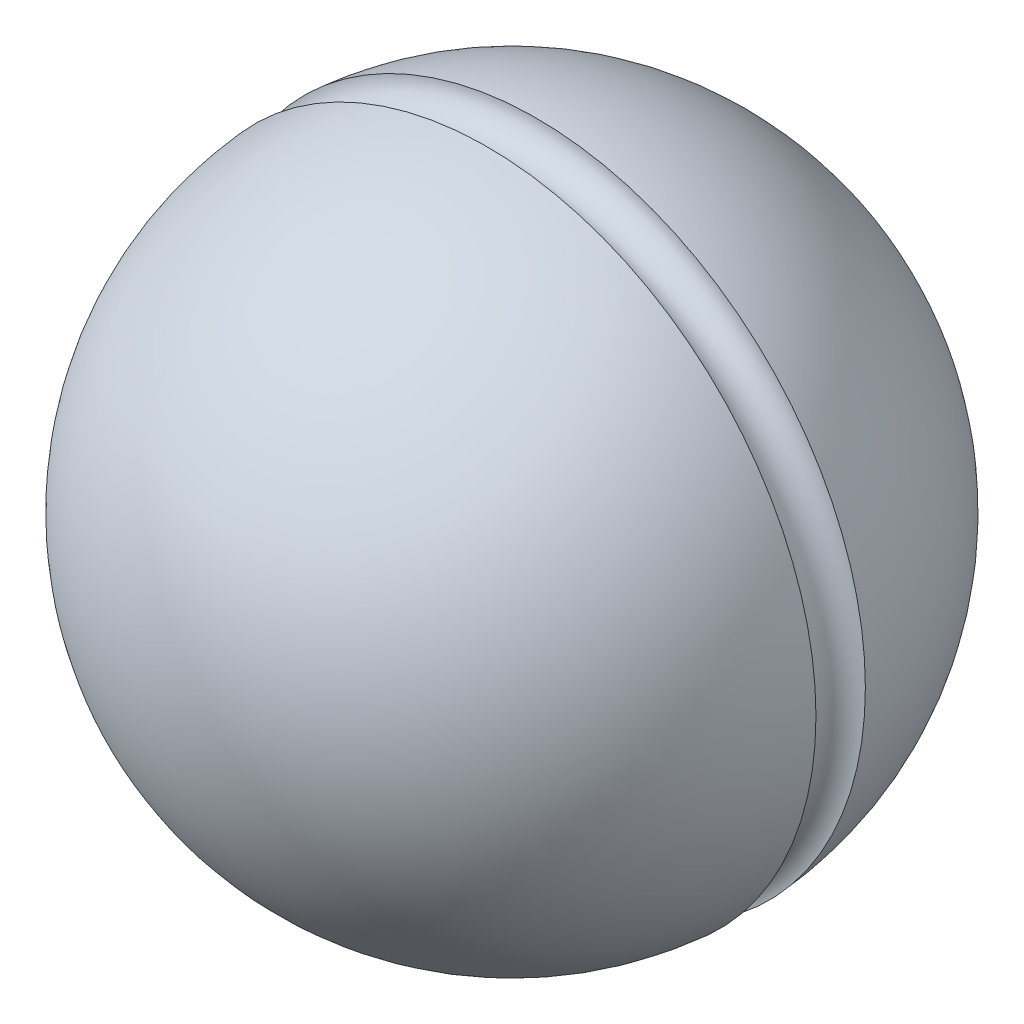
ISO-10303-21;
HEADER;
FILE_DESCRIPTION(('STEP AP214'),'2;1');
FILE_NAME('part.step','',(''),(''),'','','');
FILE_SCHEMA(('AUTOMOTIVE_DESIGN { 1 0 10303 214 1 1 1 1 }'));
ENDSEC;
DATA;
#1=APPLICATION_CONTEXT('core data for automotive mechanical design processes');
#2=APPLICATION_PROTOCOL_DEFINITION('international standard','automotive_design',2000,#1);
#3=PRODUCT_CONTEXT('',#1,'mechanical');
#4=PRODUCT('Part','Part','',(#3));
#5=PRODUCT_RELATED_PRODUCT_CATEGORY('part','',(#4));
#6=PRODUCT_DEFINITION_FORMATION('','',#4);
#7=PRODUCT_DEFINITION_CONTEXT('part definition',#1,'design');
#8=PRODUCT_DEFINITION('design','',#6,#7);
#9=PRODUCT_DEFINITION_SHAPE('','',#8);
#10=(LENGTH_UNIT() NAMED_UNIT(*) SI_UNIT(.MILLI.,.METRE.));
#11=(NAMED_UNIT(*) PLANE_ANGLE_UNIT() SI_UNIT($,.RADIAN.));
#12=(NAMED_UNIT(*) SI_UNIT($,.STERADIAN.) SOLID_ANGLE_UNIT());
#13=UNCERTAINTY_MEASURE_WITH_UNIT(LENGTH_MEASURE(1.E-05),#10,'distance_accuracy_value','');
#14=(GEOMETRIC_REPRESENTATION_CONTEXT(3) GLOBAL_UNCERTAINTY_ASSIGNED_CONTEXT((#13)) GLOBAL_UNIT_ASSIGNED_CONTEXT((#10,
#11,#12)) REPRESENTATION_CONTEXT('',''));
#15=CARTESIAN_POINT('',(0.,0.,0.));
#16=DIRECTION('',(0.,0.,1.));
#17=DIRECTION('',(1.,0.,0.));
#18=AXIS2_PLACEMENT_3D('',#15,#16,#17);
#19=CARTESIAN_POINT('',(0.,0.,9.36749699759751));
#20=DIRECTION('',(0.,0.,1.));
#21=DIRECTION('',(1.,0.,0.));
#22=AXIS2_PLACEMENT_3D('',#19,#20,#21);
#23=TOROIDAL_SURFACE('',#22,10.,0.75);
#24=CARTESIAN_POINT('',(0.,0.,10.116969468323));
#25=DIRECTION('',(0.,0.,1.));
#26=DIRECTION('',(1.,0.,0.));
#27=AXIS2_PLACEMENT_3D('',#24,#25,#26);
#28=CIRCLE('',#27,9.971875);
#29=CARTESIAN_POINT('',(9.971875,0.,10.116969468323));
#30=VERTEX_POINT('',#29);
#31=EDGE_CURVE('E31',#30,#30,#28,.T.);
#32=ORIENTED_EDGE('',*,*,#31,.F.);
#33=EDGE_LOOP('',(#32));
#34=FACE_BOUND('',#33,.T.);
#35=CARTESIAN_POINT('',(0.,0.,8.61802452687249));
#36=DIRECTION('',(0.,0.,1.));
#37=DIRECTION('',(1.,0.,0.));
#38=AXIS2_PLACEMENT_3D('',#35,#36,#37);
#39=CIRCLE('',#38,9.971875);
#40=CARTESIAN_POINT('',(9.971875,0.,8.61802452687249));
#41=VERTEX_POINT('',#40);
#42=EDGE_CURVE('E8',#41,#41,#39,.T.);
#43=ORIENTED_EDGE('',*,*,#42,.T.);
#44=EDGE_LOOP('',(#43));
#45=FACE_BOUND('',#44,.T.);
#46=ADVANCED_FACE('F12',(#34,#45),#23,.F.);
#47=CARTESIAN_POINT('',(0.,0.,9.36749699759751));
#48=DIRECTION('',(-1.,0.,0.));
#49=DIRECTION('',(0.,0.,1.));
#50=AXIS2_PLACEMENT_3D('',#47,#48,#49);
#51=SPHERICAL_SURFACE('',#50,10.);
#52=CARTESIAN_POINT('',(0.,0.,9.36749699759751));
#53=DIRECTION('',(0.,0.,1.));
#54=DIRECTION('',(1.,0.,0.));
#55=AXIS2_PLACEMENT_3D('',#52,#53,#54);
#56=SPHERICAL_SURFACE('',#55,10.);
#57=CARTESIAN_POINT('',(0.,0.,0.));
#58=DIRECTION('',(0.,0.,1.));
#59=DIRECTION('',(1.,0.,0.));
#60=AXIS2_PLACEMENT_3D('',#57,#58,#59);
#61=CIRCLE('',#60,3.5);
#62=CARTESIAN_POINT('',(3.5,0.,0.));
#63=VERTEX_POINT('',#62);
#64=EDGE_CURVE('E18',#63,#63,#61,.T.);
#65=ORIENTED_EDGE('',*,*,#64,.T.);
#66=EDGE_LOOP('',(#65));
#67=FACE_BOUND('',#66,.T.);
#68=ORIENTED_EDGE('',*,*,#42,.F.);
#69=EDGE_LOOP('',(#68));
#70=FACE_BOUND('',#69,.T.);
#71=ADVANCED_FACE('F38',(#67,#70),#56,.T.);
#72=CARTESIAN_POINT('',(0.,3.5,0.));
#73=DIRECTION('',(0.,0.,-1.));
#74=DIRECTION('',(-1.,0.,0.));
#75=AXIS2_PLACEMENT_3D('',#72,#73,#74);
#76=PLANE('',#75);
#77=CARTESIAN_POINT('',(0.,0.,0.));
#78=DIRECTION('',(0.,0.,1.));
#79=DIRECTION('',(1.,0.,0.));
#80=AXIS2_PLACEMENT_3D('',#77,#78,#79);
#81=CIRCLE('',#80,3.);
#82=CARTESIAN_POINT('',(3.,0.,0.));
#83=VERTEX_POINT('',#82);
#84=EDGE_CURVE('E22',#83,#83,#81,.T.);
#85=ORIENTED_EDGE('',*,*,#84,.T.);
#86=EDGE_LOOP('',(#85));
#87=FACE_BOUND('',#86,.T.);
#88=ORIENTED_EDGE('',*,*,#64,.F.);
#89=EDGE_LOOP('',(#88));
#90=FACE_BOUND('',#89,.T.);
#91=ADVANCED_FACE('F43',(#87,#90),#76,.T.);
#92=CARTESIAN_POINT('',(0.,0.,24.3674969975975));
#93=DIRECTION('',(0.,0.,1.));
#94=DIRECTION('',(1.,0.,0.));
#95=AXIS2_PLACEMENT_3D('',#92,#93,#94);
#96=CYLINDRICAL_SURFACE('',#95,3.);
#97=CARTESIAN_POINT('',(0.,0.,10.));
#98=DIRECTION('',(0.,0.,1.));
#99=DIRECTION('',(1.,0.,0.));
#100=AXIS2_PLACEMENT_3D('',#97,#98,#99);
#101=CIRCLE('',#100,3.);
#102=CARTESIAN_POINT('',(3.,0.,10.));
#103=VERTEX_POINT('',#102);
#104=EDGE_CURVE('E26',#103,#103,#101,.T.);
#105=ORIENTED_EDGE('',*,*,#104,.T.);
#106=EDGE_LOOP('',(#105));
#107=FACE_BOUND('',#106,.T.);
#108=ORIENTED_EDGE('',*,*,#84,.F.);
#109=EDGE_LOOP('',(#108));
#110=FACE_BOUND('',#109,.T.);
#111=ADVANCED_FACE('F47',(#107,#110),#96,.F.);
#112=CARTESIAN_POINT('',(0.,3.,10.));
#113=DIRECTION('',(0.,0.,-1.));
#114=DIRECTION('',(-1.,0.,0.));
#115=AXIS2_PLACEMENT_3D('',#112,#113,#114);
#116=PLANE('',#115);
#117=ORIENTED_EDGE('',*,*,#104,.F.);
#118=EDGE_LOOP('',(#117));
#119=FACE_BOUND('',#118,.T.);
#120=ADVANCED_FACE('F54',(#119),#116,.T.);
#121=CARTESIAN_POINT('',(0.,0.,9.36749699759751));
#122=DIRECTION('',(-1.,0.,0.));
#123=DIRECTION('',(0.,0.,1.));
#124=AXIS2_PLACEMENT_3D('',#121,#122,#123);
#125=SPHERICAL_SURFACE('',#124,10.);
#126=CARTESIAN_POINT('',(0.,0.,9.36749699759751));
#127=DIRECTION('',(0.,0.,1.));
#128=DIRECTION('',(1.,0.,0.));
#129=AXIS2_PLACEMENT_3D('',#126,#127,#128);
#130=SPHERICAL_SURFACE('',#129,10.);
#131=ORIENTED_EDGE('',*,*,#31,.T.);
#132=EDGE_LOOP('',(#131));
#133=FACE_BOUND('',#132,.T.);
#134=ADVANCED_FACE('F35',(#133),#130,.T.);
#135=CLOSED_SHELL('',(#46,#71,#91,#111,#120,#134));
#136=MANIFOLD_SOLID_BREP('B1',#135);
#137=ADVANCED_BREP_SHAPE_REPRESENTATION('',(#18,#136),#14);
#138=SHAPE_DEFINITION_REPRESENTATION(#9,#137);
ENDSEC;
END-ISO-10303-21;
